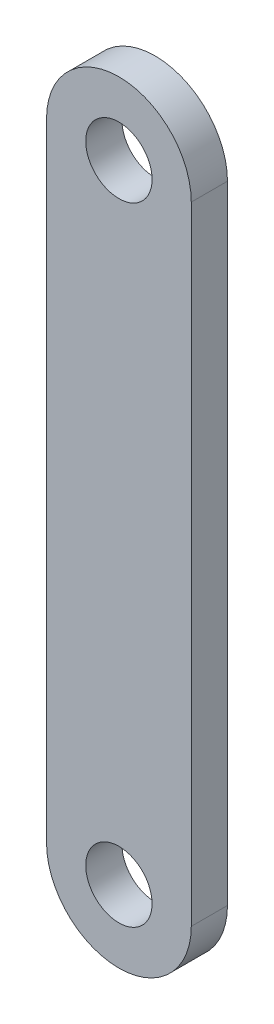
from build123d import *

# Parameters (mm, degrees)
SKETCH1_R      = 4.365625
EXTRUDE1_DEPTH = 4.7625


with BuildPart() as part:
    # Sketch1 → Extrude1 (new body)
    with BuildSketch(Plane.XY):
        with BuildLine():
            Line((-9.525, 41.275), (-9.525, -41.275))
            ThreePointArc((-9.525, -41.275), (0, -50.8), (9.525, -41.275))
            Line((9.525, -41.275), (9.525, 41.275))
            ThreePointArc((9.525, 41.275), (0, 50.8), (-9.525, 41.275))
        make_face()
        with Locations((0, 41.275)):
            Circle(SKETCH1_R, mode=Mode.SUBTRACT)
        with Locations((0, -41.275)):
            Circle(SKETCH1_R, mode=Mode.SUBTRACT)
    extrude(amount=EXTRUDE1_DEPTH)


solid = part.part
